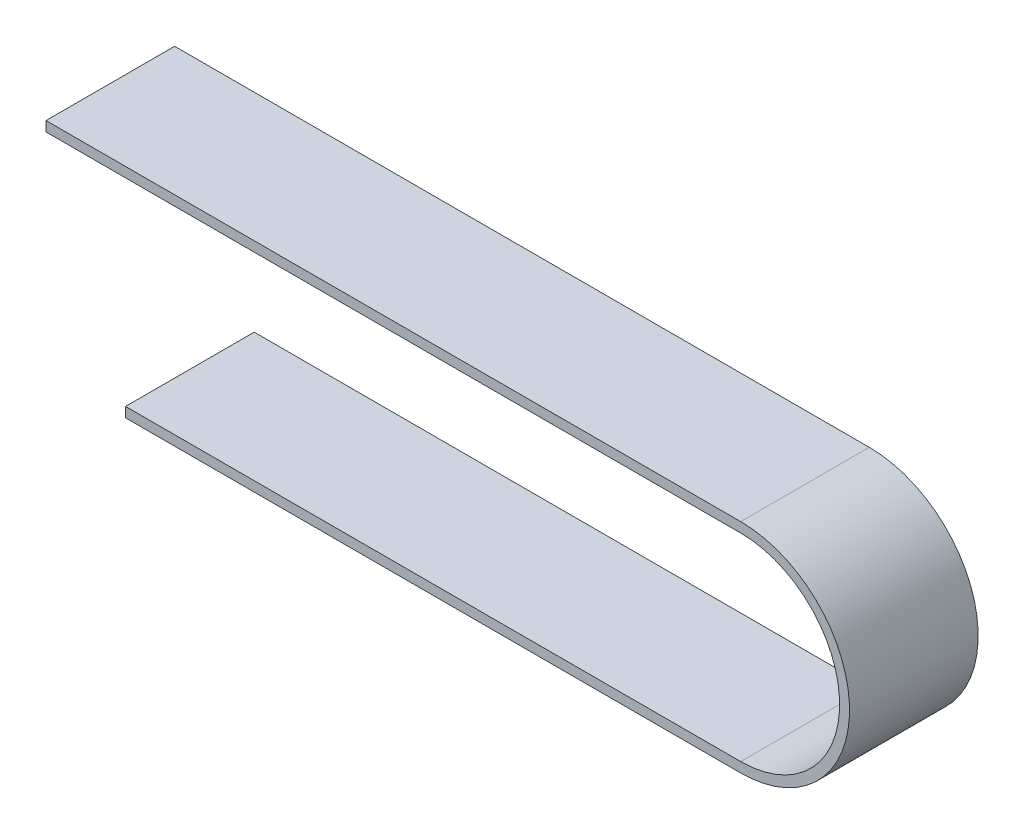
from build123d import *

# Parameters (mm, degrees)
EXTRUSION1_DEPTH = 130


with BuildPart() as part:
    # Esquisse1 → Extrusion1 (new body)
    with BuildSketch(Plane.XY):
        with BuildLine():
            Line((0, 110), (-702.000939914, 110))
            Line((-702.000939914, 110), (-702.000939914, 100))
            Line((-702.000939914, 100), (0, 100))
            ThreePointArc((0, 100), (100, 0), (0, -100))
            Line((0, -100), (-621.60305762, -100))
            Line((-621.60305762, -100), (-621.60305762, -110))
            Line((-621.60305762, -110), (0, -110))
            ThreePointArc((0, -110), (110, 0), (0, 110))
        make_face()
    extrude(amount=EXTRUSION1_DEPTH)


solid = part.part
